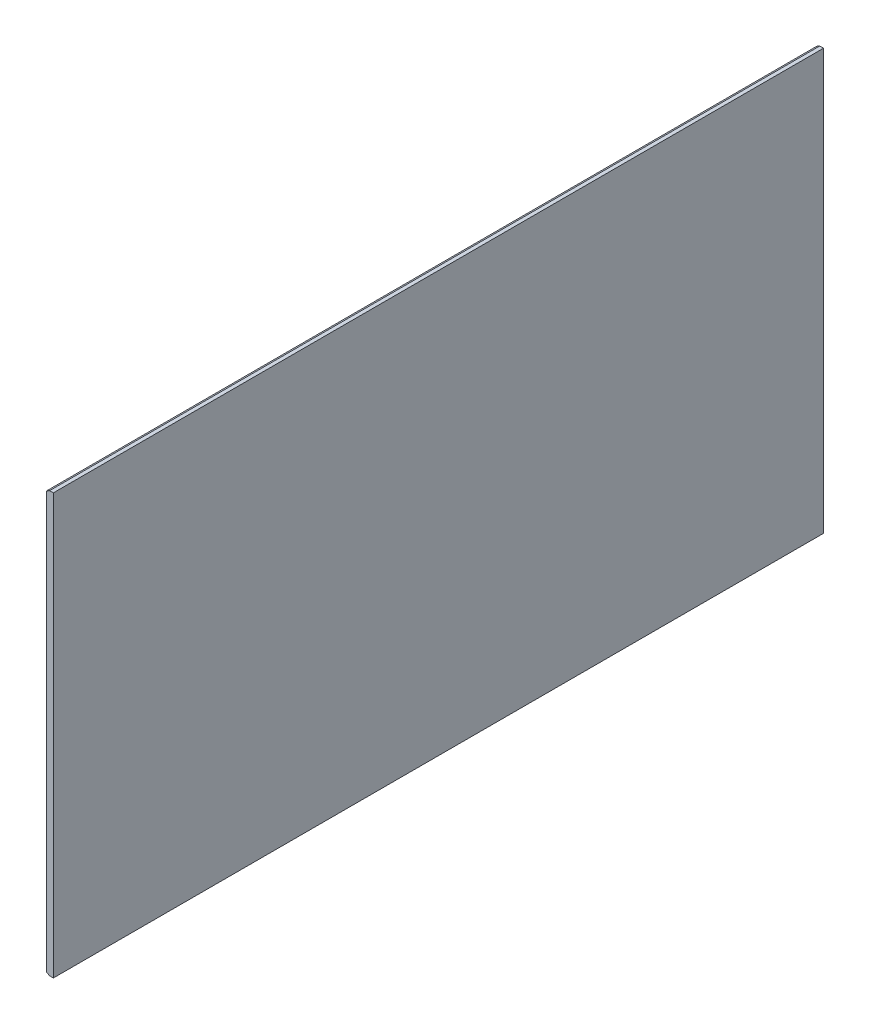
from build123d import *

# Parameters (mm, degrees)
SKETCH1_W           = 1158
SKETCH1_H           = 2122.7
BOSS_EXTRUDE1_DEPTH = 9.525
CHAMFER1_SIZE       = 5
CHAMFER1_SIZE2      = 8.660254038


with BuildPart() as part:
    # Sketch1 → Boss-Extrude1 (new, symmetric)
    with BuildSketch(Plane.YZ):
        Rectangle(SKETCH1_W, SKETCH1_H)
    extrude(amount=BOSS_EXTRUDE1_DEPTH, both=True)

    # Chamfer1
    chamfer1_edges = [part.edges().sort_by_distance(p)[0] for p in [
        (-9.525, -579, 0),
        (-9.525, 579, 0),
    ]]
    chamfer1_side = [part.faces().sort_by_distance(p)[0] for p in [
        (-9.525, 0, 0),
    ]]
    chamfer(chamfer1_edges, length=CHAMFER1_SIZE, length2=CHAMFER1_SIZE2, reference=chamfer1_side[0])


solid = part.part
